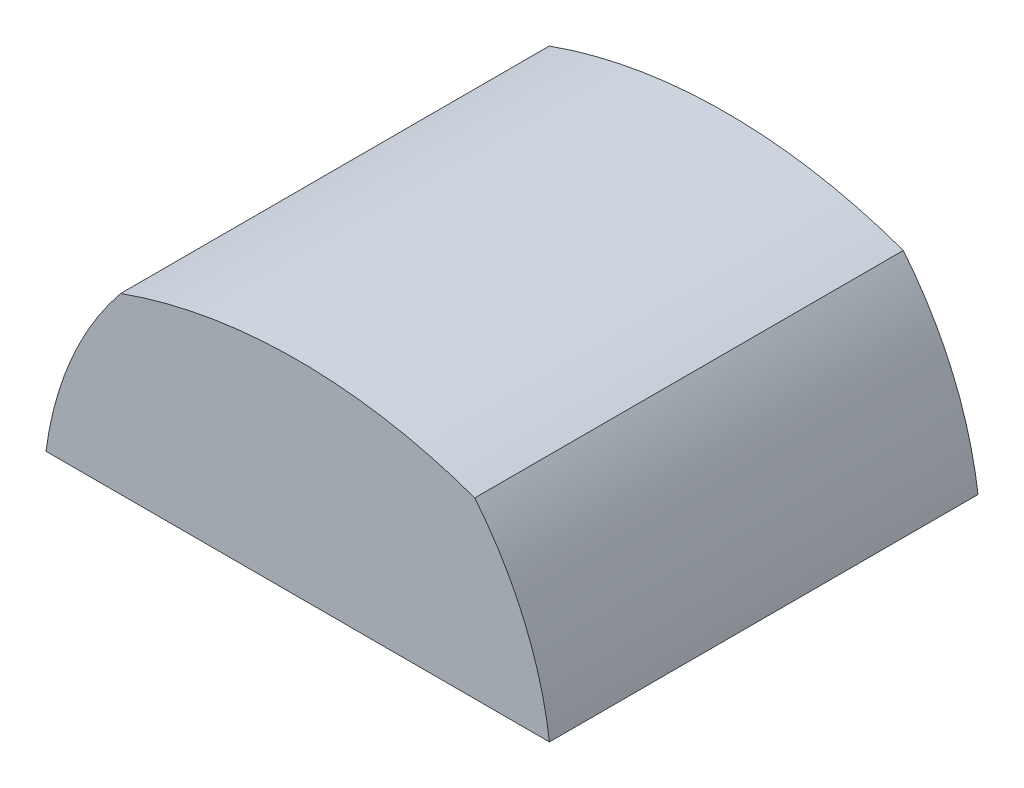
ISO-10303-21;
HEADER;
FILE_DESCRIPTION(('STEP AP214'),'2;1');
FILE_NAME('part.step','',(''),(''),'','','');
FILE_SCHEMA(('AUTOMOTIVE_DESIGN { 1 0 10303 214 1 1 1 1 }'));
ENDSEC;
DATA;
#1=APPLICATION_CONTEXT('core data for automotive mechanical design processes');
#2=APPLICATION_PROTOCOL_DEFINITION('international standard','automotive_design',2000,#1);
#3=PRODUCT_CONTEXT('',#1,'mechanical');
#4=PRODUCT('Part','Part','',(#3));
#5=PRODUCT_RELATED_PRODUCT_CATEGORY('part','',(#4));
#6=PRODUCT_DEFINITION_FORMATION('','',#4);
#7=PRODUCT_DEFINITION_CONTEXT('part definition',#1,'design');
#8=PRODUCT_DEFINITION('design','',#6,#7);
#9=PRODUCT_DEFINITION_SHAPE('','',#8);
#10=(LENGTH_UNIT() NAMED_UNIT(*) SI_UNIT(.MILLI.,.METRE.));
#11=(NAMED_UNIT(*) PLANE_ANGLE_UNIT() SI_UNIT($,.RADIAN.));
#12=(NAMED_UNIT(*) SI_UNIT($,.STERADIAN.) SOLID_ANGLE_UNIT());
#13=UNCERTAINTY_MEASURE_WITH_UNIT(LENGTH_MEASURE(1.E-05),#10,'distance_accuracy_value','');
#14=(GEOMETRIC_REPRESENTATION_CONTEXT(3) GLOBAL_UNCERTAINTY_ASSIGNED_CONTEXT((#13)) GLOBAL_UNIT_ASSIGNED_CONTEXT((#10,
#11,#12)) REPRESENTATION_CONTEXT('',''));
#15=CARTESIAN_POINT('',(0.,0.,0.));
#16=DIRECTION('',(0.,0.,1.));
#17=DIRECTION('',(1.,0.,0.));
#18=AXIS2_PLACEMENT_3D('',#15,#16,#17);
#19=CARTESIAN_POINT('',(19.5561187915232,-9.45350407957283,91.694));
#20=DIRECTION('',(0.,0.,-1.));
#21=DIRECTION('',(-1.,0.,0.));
#22=AXIS2_PLACEMENT_3D('',#19,#20,#21);
#23=CYLINDRICAL_SURFACE('',#22,74.0198235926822);
#24=CARTESIAN_POINT('',(19.5561187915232,-9.45350407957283,0.));
#25=DIRECTION('',(0.,0.,1.));
#26=DIRECTION('',(-1.,0.,0.));
#27=AXIS2_PLACEMENT_3D('',#24,#25,#26);
#28=CIRCLE('',#27,74.0198235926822);
#29=CARTESIAN_POINT('',(-37.8806632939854,37.2364343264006,0.));
#30=VERTEX_POINT('',#29);
#31=CARTESIAN_POINT('',(-53.857541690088,0.,0.));
#32=VERTEX_POINT('',#31);
#33=EDGE_CURVE('E76',#30,#32,#28,.T.);
#34=ORIENTED_EDGE('',*,*,#33,.T.);
#35=DIRECTION('',(0.,0.,-1.));
#36=VECTOR('',#35,1.);
#37=CARTESIAN_POINT('',(-53.857541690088,0.,91.694));
#38=LINE('',#37,#36);
#39=CARTESIAN_POINT('',(-53.857541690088,0.,91.694));
#40=VERTEX_POINT('',#39);
#41=EDGE_CURVE('E11',#40,#32,#38,.T.);
#42=ORIENTED_EDGE('',*,*,#41,.F.);
#43=CARTESIAN_POINT('',(19.5561187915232,-9.45350407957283,91.694));
#44=DIRECTION('',(0.,0.,1.));
#45=DIRECTION('',(-1.,0.,0.));
#46=AXIS2_PLACEMENT_3D('',#43,#44,#45);
#47=CIRCLE('',#46,74.0198235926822);
#48=CARTESIAN_POINT('',(-37.8806632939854,37.2364343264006,91.694));
#49=VERTEX_POINT('',#48);
#50=EDGE_CURVE('E94',#49,#40,#47,.T.);
#51=ORIENTED_EDGE('',*,*,#50,.F.);
#52=DIRECTION('',(0.,0.,-1.));
#53=VECTOR('',#52,1.);
#54=CARTESIAN_POINT('',(-37.8806632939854,37.2364343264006,91.694));
#55=LINE('',#54,#53);
#56=EDGE_CURVE('E88',#49,#30,#55,.T.);
#57=ORIENTED_EDGE('',*,*,#56,.T.);
#58=EDGE_LOOP('',(#34,#42,#51,#57));
#59=FACE_BOUND('',#58,.T.);
#60=ADVANCED_FACE('F32',(#59),#23,.T.);
#61=CARTESIAN_POINT('',(-53.857541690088,0.,91.694));
#62=DIRECTION('',(0.,1.,0.));
#63=DIRECTION('',(0.,0.,1.));
#64=AXIS2_PLACEMENT_3D('',#61,#62,#63);
#65=PLANE('',#64);
#66=DIRECTION('',(1.,0.,0.));
#67=VECTOR('',#66,1.);
#68=CARTESIAN_POINT('',(-53.857541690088,0.,0.));
#69=LINE('',#68,#67);
#70=CARTESIAN_POINT('',(53.857541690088,0.,0.));
#71=VERTEX_POINT('',#70);
#72=EDGE_CURVE('E72',#32,#71,#69,.T.);
#73=ORIENTED_EDGE('',*,*,#72,.T.);
#74=DIRECTION('',(0.,0.,-1.));
#75=VECTOR('',#74,1.);
#76=CARTESIAN_POINT('',(53.857541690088,0.,91.694));
#77=LINE('',#76,#75);
#78=CARTESIAN_POINT('',(53.857541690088,0.,91.694));
#79=VERTEX_POINT('',#78);
#80=EDGE_CURVE('E39',#79,#71,#77,.T.);
#81=ORIENTED_EDGE('',*,*,#80,.F.);
#82=DIRECTION('',(1.,0.,0.));
#83=VECTOR('',#82,1.);
#84=CARTESIAN_POINT('',(-53.857541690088,0.,91.694));
#85=LINE('',#84,#83);
#86=EDGE_CURVE('E84',#40,#79,#85,.T.);
#87=ORIENTED_EDGE('',*,*,#86,.F.);
#88=ORIENTED_EDGE('',*,*,#41,.T.);
#89=EDGE_LOOP('',(#73,#81,#87,#88));
#90=FACE_BOUND('',#89,.T.);
#91=ADVANCED_FACE('F83',(#90),#65,.F.);
#92=CARTESIAN_POINT('',(-19.5561187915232,-9.45350407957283,91.694));
#93=DIRECTION('',(0.,0.,-1.));
#94=DIRECTION('',(-1.,0.,0.));
#95=AXIS2_PLACEMENT_3D('',#92,#93,#94);
#96=CYLINDRICAL_SURFACE('',#95,74.0198235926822);
#97=CARTESIAN_POINT('',(-19.5561187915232,-9.45350407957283,0.));
#98=DIRECTION('',(0.,0.,1.));
#99=DIRECTION('',(1.,0.,0.));
#100=AXIS2_PLACEMENT_3D('',#97,#98,#99);
#101=CIRCLE('',#100,74.0198235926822);
#102=CARTESIAN_POINT('',(37.8806632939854,37.2364343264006,0.));
#103=VERTEX_POINT('',#102);
#104=EDGE_CURVE('E77',#71,#103,#101,.T.);
#105=ORIENTED_EDGE('',*,*,#104,.T.);
#106=DIRECTION('',(0.,0.,-1.));
#107=VECTOR('',#106,1.);
#108=CARTESIAN_POINT('',(37.8806632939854,37.2364343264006,91.694));
#109=LINE('',#108,#107);
#110=CARTESIAN_POINT('',(37.8806632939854,37.2364343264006,91.694));
#111=VERTEX_POINT('',#110);
#112=EDGE_CURVE('E100',#111,#103,#109,.T.);
#113=ORIENTED_EDGE('',*,*,#112,.F.);
#114=CARTESIAN_POINT('',(-19.5561187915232,-9.45350407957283,91.694));
#115=DIRECTION('',(0.,0.,1.));
#116=DIRECTION('',(1.,0.,0.));
#117=AXIS2_PLACEMENT_3D('',#114,#115,#116);
#118=CIRCLE('',#117,74.0198235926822);
#119=EDGE_CURVE('E51',#79,#111,#118,.T.);
#120=ORIENTED_EDGE('',*,*,#119,.F.);
#121=ORIENTED_EDGE('',*,*,#80,.T.);
#122=EDGE_LOOP('',(#105,#113,#120,#121));
#123=FACE_BOUND('',#122,.T.);
#124=ADVANCED_FACE('F103',(#123),#96,.T.);
#125=CARTESIAN_POINT('',(0.,-68.4171163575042,91.694));
#126=DIRECTION('',(0.,0.,-1.));
#127=DIRECTION('',(-1.,0.,0.));
#128=AXIS2_PLACEMENT_3D('',#125,#126,#127);
#129=CYLINDRICAL_SURFACE('',#128,112.239108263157);
#130=CARTESIAN_POINT('',(0.,-68.4171163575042,0.));
#131=DIRECTION('',(0.,0.,1.));
#132=DIRECTION('',(-1.,0.,0.));
#133=AXIS2_PLACEMENT_3D('',#130,#131,#132);
#134=CIRCLE('',#133,112.239108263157);
#135=EDGE_CURVE('E92',#103,#30,#134,.T.);
#136=ORIENTED_EDGE('',*,*,#135,.T.);
#137=ORIENTED_EDGE('',*,*,#56,.F.);
#138=CARTESIAN_POINT('',(0.,-68.4171163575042,91.694));
#139=DIRECTION('',(0.,0.,1.));
#140=DIRECTION('',(-1.,0.,0.));
#141=AXIS2_PLACEMENT_3D('',#138,#139,#140);
#142=CIRCLE('',#141,112.239108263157);
#143=EDGE_CURVE('E46',#111,#49,#142,.T.);
#144=ORIENTED_EDGE('',*,*,#143,.F.);
#145=ORIENTED_EDGE('',*,*,#112,.T.);
#146=EDGE_LOOP('',(#136,#137,#144,#145));
#147=FACE_BOUND('',#146,.T.);
#148=ADVANCED_FACE('F105',(#147),#129,.T.);
#149=CARTESIAN_POINT('',(19.5561187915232,-9.45350407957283,91.694));
#150=DIRECTION('',(0.,0.,-1.));
#151=DIRECTION('',(-1.,0.,0.));
#152=AXIS2_PLACEMENT_3D('',#149,#150,#151);
#153=PLANE('',#152);
#154=ORIENTED_EDGE('',*,*,#50,.T.);
#155=ORIENTED_EDGE('',*,*,#86,.T.);
#156=ORIENTED_EDGE('',*,*,#119,.T.);
#157=ORIENTED_EDGE('',*,*,#143,.T.);
#158=EDGE_LOOP('',(#154,#155,#156,#157));
#159=FACE_BOUND('',#158,.T.);
#160=ADVANCED_FACE('F106',(#159),#153,.F.);
#161=CARTESIAN_POINT('',(19.5561187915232,-9.45350407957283,0.));
#162=DIRECTION('',(0.,0.,-1.));
#163=DIRECTION('',(-1.,0.,0.));
#164=AXIS2_PLACEMENT_3D('',#161,#162,#163);
#165=PLANE('',#164);
#166=ORIENTED_EDGE('',*,*,#33,.F.);
#167=ORIENTED_EDGE('',*,*,#135,.F.);
#168=ORIENTED_EDGE('',*,*,#104,.F.);
#169=ORIENTED_EDGE('',*,*,#72,.F.);
#170=EDGE_LOOP('',(#166,#167,#168,#169));
#171=FACE_BOUND('',#170,.T.);
#172=ADVANCED_FACE('F73',(#171),#165,.T.);
#173=CLOSED_SHELL('',(#60,#91,#124,#148,#160,#172));
#174=MANIFOLD_SOLID_BREP('B2',#173);
#175=ADVANCED_BREP_SHAPE_REPRESENTATION('',(#18,#174),#14);
#176=SHAPE_DEFINITION_REPRESENTATION(#9,#175);
ENDSEC;
END-ISO-10303-21;
